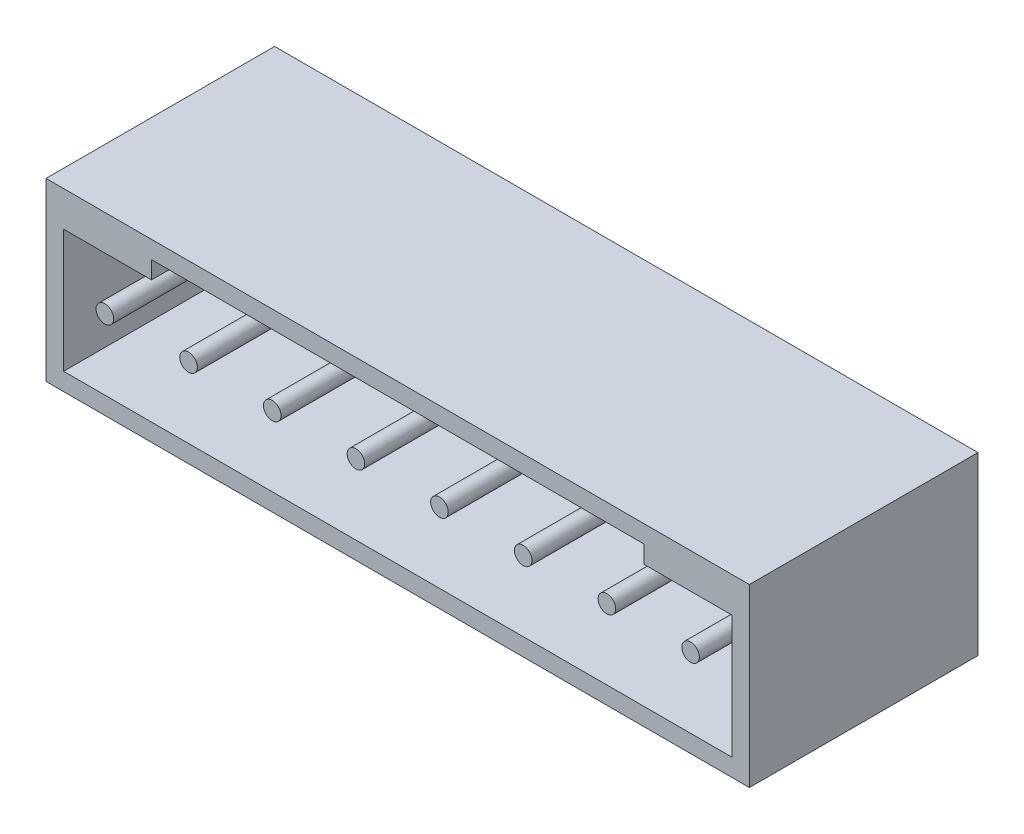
from build123d import *

# Parameters (mm, degrees)
SKETCH_1_W      = 20
SKETCH_1_H      = 5
EXTRUDE_1_DEPTH = 6
SKETCH_2_W      = 20
SKETCH_2_H      = 5
EXTRUDE_2_DEPTH = 0.5
SKETCH_3_R      = 0.25
EXTRUDE_3_DEPTH = 6


with BuildPart() as part:
    # Sketch 1 → Extrude 1 (new body)
    with BuildSketch(Plane.XY):
        Rectangle(SKETCH_1_W, SKETCH_1_H)
        Polygon((-9.5, -2), (-9.5, 1.5), (-7, 1.5), (-7, 2), (7, 2), (7, 1.5), (9.5, 1.5), (9.5, -2), align=None, mode=Mode.SUBTRACT)
    extrude(amount=EXTRUDE_1_DEPTH)

    # Sketch 2 → Extrude 2 (add)
    with BuildSketch(Plane(origin=(0, 0, 0), x_dir=(-1, 0, 0), z_dir=(0, 0, -1))):
        Rectangle(SKETCH_2_W, SKETCH_2_H)
    extrude(amount=EXTRUDE_2_DEPTH)

    # Sketch 3 → Extrude 3 (add)
    with BuildSketch(Plane.XY):
        with Locations(Location((-1.1875, 0, 0), (0, 0, 180))):
            Circle(SKETCH_3_R)
        with Locations(Location((-3.5675, 0, 0), (0, 0, 180))):
            Circle(SKETCH_3_R)
        with Locations(Location((-5.9475, 0, 0), (0, 0, 180))):
            Circle(SKETCH_3_R)
        with Locations(Location((-8.3275, 0, 0), (0, 0, 180))):
            Circle(SKETCH_3_R)
        with Locations(Location((1.1875, 0, 0), (0, 0, 180))):
            Circle(SKETCH_3_R)
        with Locations(Location((3.5675, 0, 0), (0, 0, 180))):
            Circle(SKETCH_3_R)
        with Locations(Location((5.9475, 0, 0), (0, 0, 180))):
            Circle(SKETCH_3_R)
        with Locations(Location((8.3275, 0, 0), (0, 0, 180))):
            Circle(SKETCH_3_R)
    extrude(amount=EXTRUDE_3_DEPTH)


solid = part.part
